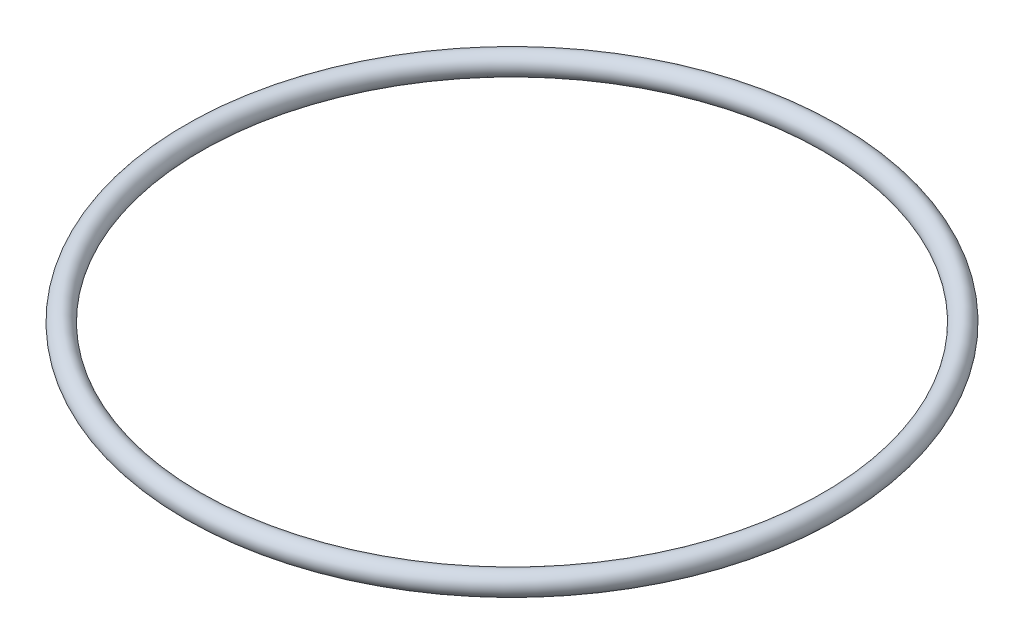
ISO-10303-21;
HEADER;
FILE_DESCRIPTION(('STEP AP214'),'2;1');
FILE_NAME('part.step','',(''),(''),'','','');
FILE_SCHEMA(('AUTOMOTIVE_DESIGN { 1 0 10303 214 1 1 1 1 }'));
ENDSEC;
DATA;
#1=APPLICATION_CONTEXT('core data for automotive mechanical design processes');
#2=APPLICATION_PROTOCOL_DEFINITION('international standard','automotive_design',2000,#1);
#3=PRODUCT_CONTEXT('',#1,'mechanical');
#4=PRODUCT('Part','Part','',(#3));
#5=PRODUCT_RELATED_PRODUCT_CATEGORY('part','',(#4));
#6=PRODUCT_DEFINITION_FORMATION('','',#4);
#7=PRODUCT_DEFINITION_CONTEXT('part definition',#1,'design');
#8=PRODUCT_DEFINITION('design','',#6,#7);
#9=PRODUCT_DEFINITION_SHAPE('','',#8);
#10=(LENGTH_UNIT() NAMED_UNIT(*) SI_UNIT(.MILLI.,.METRE.));
#11=(NAMED_UNIT(*) PLANE_ANGLE_UNIT() SI_UNIT($,.RADIAN.));
#12=(NAMED_UNIT(*) SI_UNIT($,.STERADIAN.) SOLID_ANGLE_UNIT());
#13=UNCERTAINTY_MEASURE_WITH_UNIT(LENGTH_MEASURE(1.E-05),#10,'distance_accuracy_value','');
#14=(GEOMETRIC_REPRESENTATION_CONTEXT(3) GLOBAL_UNCERTAINTY_ASSIGNED_CONTEXT((#13)) GLOBAL_UNIT_ASSIGNED_CONTEXT((#10,
#11,#12)) REPRESENTATION_CONTEXT('',''));
#15=CARTESIAN_POINT('',(0.,0.,0.));
#16=DIRECTION('',(0.,0.,1.));
#17=DIRECTION('',(1.,0.,0.));
#18=AXIS2_PLACEMENT_3D('',#15,#16,#17);
#19=CARTESIAN_POINT('',(0.,0.,0.));
#20=DIRECTION('',(0.,-1.,0.));
#21=DIRECTION('',(0.,0.,-1.));
#22=AXIS2_PLACEMENT_3D('',#19,#20,#21);
#23=TOROIDAL_SURFACE('',#22,26.289,0.889000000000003);
#24=CARTESIAN_POINT('',(0.,0.,-27.178));
#25=VERTEX_POINT('',#24);
#26=VERTEX_LOOP('',#25);
#27=FACE_BOUND('',#26,.T.);
#28=ADVANCED_FACE('F30',(#27),#23,.T.);
#29=CLOSED_SHELL('',(#28));
#30=MANIFOLD_SOLID_BREP('B2',#29);
#31=ADVANCED_BREP_SHAPE_REPRESENTATION('',(#18,#30),#14);
#32=SHAPE_DEFINITION_REPRESENTATION(#9,#31);
ENDSEC;
END-ISO-10303-21;
